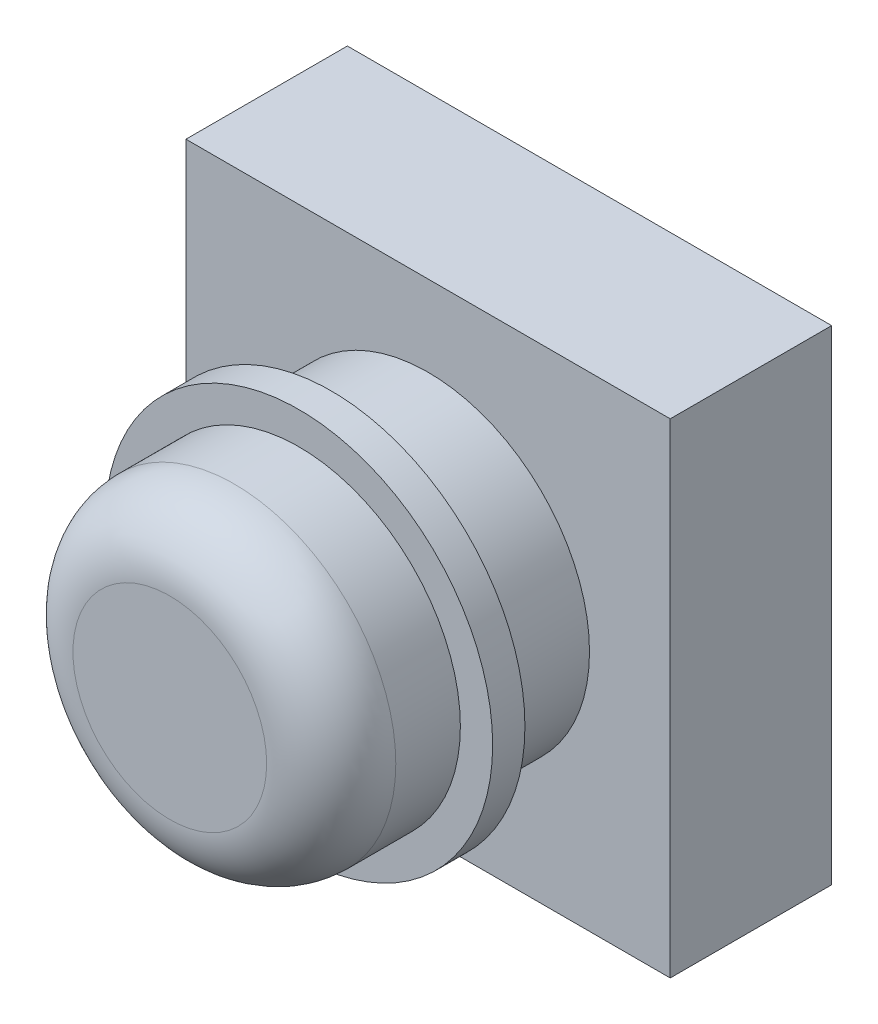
from build123d import *

# Parameters (mm, degrees)
SKETCH1_W           = 15
SKETCH1_H           = 15
BASE_EXTRUDE_DEPTH  = 5
SKETCH2_R           = 5
BOSS_EXTRUDE1_DEPTH = 8
FILLET2_R           = 2
SKETCH4_R           = 6
SKETCH4_R_2         = 5
BOSS_EXTRUDE2_DEPTH = 1


with BuildPart() as part:
    # Sketch1 → Base-Extrude (new body)
    with BuildSketch(Plane.XY):
        Rectangle(SKETCH1_W, SKETCH1_H)
    extrude(amount=BASE_EXTRUDE_DEPTH)

    # Sketch2 → Boss-Extrude1 (add)
    with BuildSketch(Plane.XY.offset(5)):
        Circle(SKETCH2_R)
    extrude(amount=BOSS_EXTRUDE1_DEPTH)

    # Fillet2
    fillet2_edges = [part.edges().sort_by_distance(p)[0] for p in [
        (-5, 0, 13),
    ]]
    fillet(fillet2_edges, radius=FILLET2_R)

    # Sketch4 → Boss-Extrude2 (add)
    with BuildSketch(Plane.XY.offset(8)):
        Circle(SKETCH4_R)
        Circle(SKETCH4_R_2, mode=Mode.SUBTRACT)
    extrude(amount=BOSS_EXTRUDE2_DEPTH)


solid = part.part
